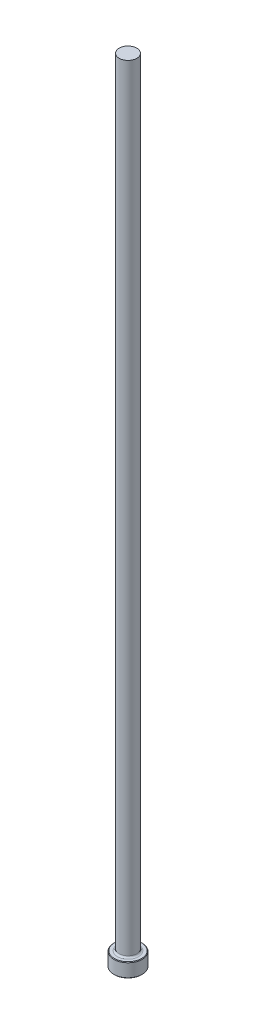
from build123d import *

# Parameters (mm, degrees)
CHAMFER1_SIZE = 0.254
FILLET1_R     = 0.762


with BuildPart() as part:
    # Sketch1 → Revolve1 (revolve)
    with BuildSketch(Plane.XY, mode=Mode.PRIVATE) as revolve1_sk:
        Polygon((0, 0), (-6.35, 0), (-6.35, 6.35), (-3.96875, 6.35), (-3.96875, 355.6), (0, 355.6), align=None)
    revolve(revolve1_sk.sketch.rotate(Axis((0, 259.958771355, 0), (0, -1, 0)), 270), axis=Axis((0, 259.958771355, 0), (0, -1, 0)))

    # Chamfer1
    chamfer1_edges = [part.edges().sort_by_distance(p)[0] for p in [
        (0, 6.35, -6.35),
        (0, 0, -6.35),
    ]]
    chamfer(chamfer1_edges, length=CHAMFER1_SIZE)

    # Fillet1
    fillet1_edges = [part.edges().sort_by_distance(p)[0] for p in [
        (0, 6.35, -3.96875),
    ]]
    fillet(fillet1_edges, radius=FILLET1_R)


solid = part.part
